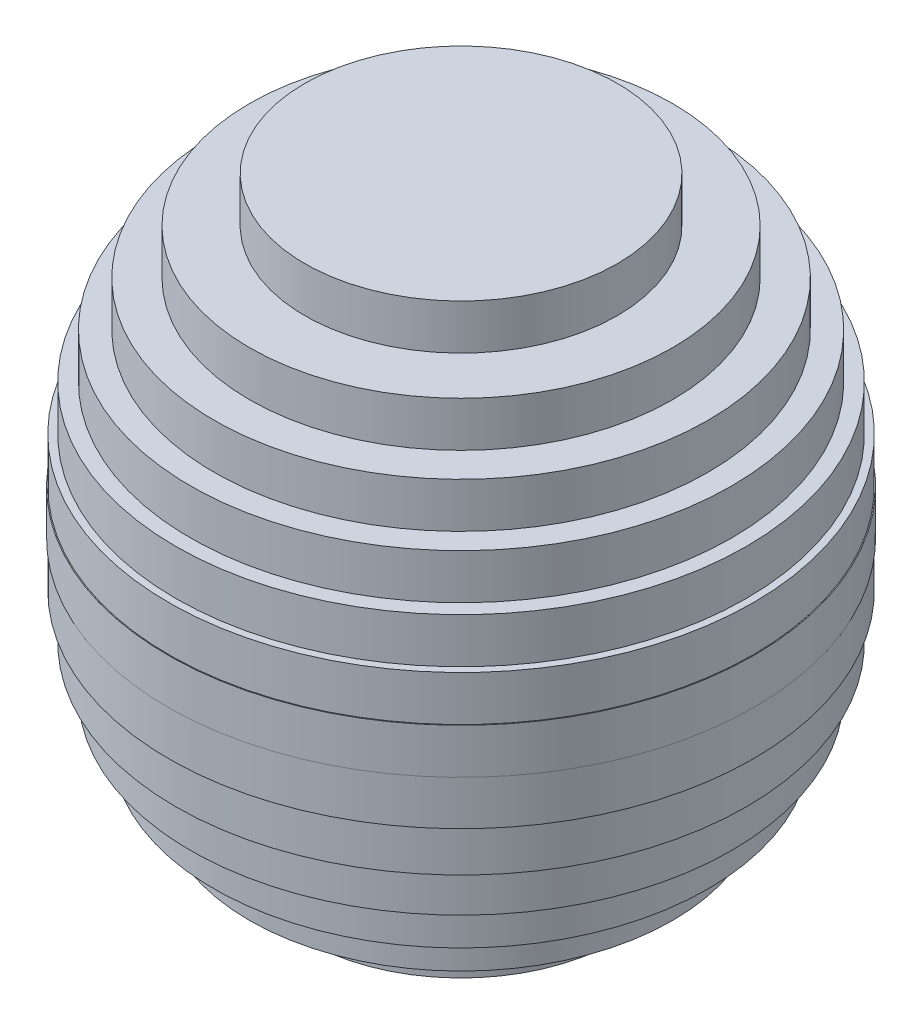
ISO-10303-21;
HEADER;
FILE_DESCRIPTION(('STEP AP214'),'2;1');
FILE_NAME('part.step','',(''),(''),'','','');
FILE_SCHEMA(('AUTOMOTIVE_DESIGN { 1 0 10303 214 1 1 1 1 }'));
ENDSEC;
DATA;
#1=APPLICATION_CONTEXT('core data for automotive mechanical design processes');
#2=APPLICATION_PROTOCOL_DEFINITION('international standard','automotive_design',2000,#1);
#3=PRODUCT_CONTEXT('',#1,'mechanical');
#4=PRODUCT('Part','Part','',(#3));
#5=PRODUCT_RELATED_PRODUCT_CATEGORY('part','',(#4));
#6=PRODUCT_DEFINITION_FORMATION('','',#4);
#7=PRODUCT_DEFINITION_CONTEXT('part definition',#1,'design');
#8=PRODUCT_DEFINITION('design','',#6,#7);
#9=PRODUCT_DEFINITION_SHAPE('','',#8);
#10=(LENGTH_UNIT() NAMED_UNIT(*) SI_UNIT(.MILLI.,.METRE.));
#11=(NAMED_UNIT(*) PLANE_ANGLE_UNIT() SI_UNIT($,.RADIAN.));
#12=(NAMED_UNIT(*) SI_UNIT($,.STERADIAN.) SOLID_ANGLE_UNIT());
#13=UNCERTAINTY_MEASURE_WITH_UNIT(LENGTH_MEASURE(1.E-05),#10,'distance_accuracy_value','');
#14=(GEOMETRIC_REPRESENTATION_CONTEXT(3) GLOBAL_UNCERTAINTY_ASSIGNED_CONTEXT((#13)) GLOBAL_UNIT_ASSIGNED_CONTEXT((#10,
#11,#12)) REPRESENTATION_CONTEXT('',''));
#15=CARTESIAN_POINT('',(0.,0.,0.));
#16=DIRECTION('',(0.,0.,1.));
#17=DIRECTION('',(1.,0.,0.));
#18=AXIS2_PLACEMENT_3D('',#15,#16,#17);
#19=CARTESIAN_POINT('',(32.4037034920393,-2.50000000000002,0.));
#20=DIRECTION('',(0.,-1.,0.));
#21=DIRECTION('',(1.,0.,0.));
#22=AXIS2_PLACEMENT_3D('',#19,#20,#21);
#23=PLANE('',#22);
#24=CARTESIAN_POINT('',(0.,-2.50000000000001,0.));
#25=DIRECTION('',(0.,-1.,0.));
#26=DIRECTION('',(1.,0.,0.));
#27=AXIS2_PLACEMENT_3D('',#24,#25,#26);
#28=CIRCLE('',#27,32.4999999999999);
#29=CARTESIAN_POINT('',(32.4999999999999,-2.50000000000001,0.));
#30=VERTEX_POINT('',#29);
#31=EDGE_CURVE('E10',#30,#30,#28,.T.);
#32=ORIENTED_EDGE('',*,*,#31,.T.);
#33=EDGE_LOOP('',(#32));
#34=FACE_BOUND('',#33,.T.);
#35=CARTESIAN_POINT('',(0.,-2.50000000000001,0.));
#36=DIRECTION('',(0.,-1.,0.));
#37=DIRECTION('',(1.,0.,0.));
#38=AXIS2_PLACEMENT_3D('',#35,#36,#37);
#39=CIRCLE('',#38,32.4037034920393);
#40=CARTESIAN_POINT('',(32.4037034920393,-2.50000000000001,0.));
#41=VERTEX_POINT('',#40);
#42=EDGE_CURVE('E114',#41,#41,#39,.T.);
#43=ORIENTED_EDGE('',*,*,#42,.F.);
#44=EDGE_LOOP('',(#43));
#45=FACE_BOUND('',#44,.T.);
#46=ADVANCED_FACE('F32',(#34,#45),#23,.T.);
#47=CARTESIAN_POINT('',(0.,-32.5,0.));
#48=DIRECTION('',(0.,-1.,0.));
#49=DIRECTION('',(1.,0.,0.));
#50=AXIS2_PLACEMENT_3D('',#47,#48,#49);
#51=CYLINDRICAL_SURFACE('',#50,32.4999999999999);
#52=CARTESIAN_POINT('',(0.,2.49999999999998,0.));
#53=DIRECTION('',(0.,-1.,0.));
#54=DIRECTION('',(1.,0.,0.));
#55=AXIS2_PLACEMENT_3D('',#52,#53,#54);
#56=CIRCLE('',#55,32.4999999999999);
#57=CARTESIAN_POINT('',(32.4999999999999,2.49999999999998,0.));
#58=VERTEX_POINT('',#57);
#59=EDGE_CURVE('E38',#58,#58,#56,.T.);
#60=ORIENTED_EDGE('',*,*,#59,.T.);
#61=EDGE_LOOP('',(#60));
#62=FACE_BOUND('',#61,.T.);
#63=ORIENTED_EDGE('',*,*,#31,.F.);
#64=EDGE_LOOP('',(#63));
#65=FACE_BOUND('',#64,.T.);
#66=ADVANCED_FACE('F122',(#62,#65),#51,.T.);
#67=CARTESIAN_POINT('',(32.4999999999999,2.49999999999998,0.));
#68=DIRECTION('',(0.,1.,0.));
#69=DIRECTION('',(-1.,0.,0.));
#70=AXIS2_PLACEMENT_3D('',#67,#68,#69);
#71=PLANE('',#70);
#72=CARTESIAN_POINT('',(0.,2.49999999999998,0.));
#73=DIRECTION('',(0.,-1.,0.));
#74=DIRECTION('',(1.,0.,0.));
#75=AXIS2_PLACEMENT_3D('',#72,#73,#74);
#76=CIRCLE('',#75,32.4037034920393);
#77=CARTESIAN_POINT('',(32.4037034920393,2.49999999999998,0.));
#78=VERTEX_POINT('',#77);
#79=EDGE_CURVE('E42',#78,#78,#76,.T.);
#80=ORIENTED_EDGE('',*,*,#79,.T.);
#81=EDGE_LOOP('',(#80));
#82=FACE_BOUND('',#81,.T.);
#83=ORIENTED_EDGE('',*,*,#59,.F.);
#84=EDGE_LOOP('',(#83));
#85=FACE_BOUND('',#84,.T.);
#86=ADVANCED_FACE('F126',(#82,#85),#71,.T.);
#87=CARTESIAN_POINT('',(0.,-32.5,0.));
#88=DIRECTION('',(0.,-1.,0.));
#89=DIRECTION('',(1.,0.,0.));
#90=AXIS2_PLACEMENT_3D('',#87,#88,#89);
#91=CYLINDRICAL_SURFACE('',#90,32.4037034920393);
#92=CARTESIAN_POINT('',(0.,7.49999999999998,0.));
#93=DIRECTION('',(0.,-1.,0.));
#94=DIRECTION('',(1.,0.,0.));
#95=AXIS2_PLACEMENT_3D('',#92,#93,#94);
#96=CIRCLE('',#95,32.4037034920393);
#97=CARTESIAN_POINT('',(32.4037034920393,7.49999999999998,0.));
#98=VERTEX_POINT('',#97);
#99=EDGE_CURVE('E46',#98,#98,#96,.T.);
#100=ORIENTED_EDGE('',*,*,#99,.T.);
#101=EDGE_LOOP('',(#100));
#102=FACE_BOUND('',#101,.T.);
#103=ORIENTED_EDGE('',*,*,#79,.F.);
#104=EDGE_LOOP('',(#103));
#105=FACE_BOUND('',#104,.T.);
#106=ADVANCED_FACE('F130',(#102,#105),#91,.T.);
#107=CARTESIAN_POINT('',(32.4037034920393,7.49999999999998,0.));
#108=DIRECTION('',(0.,1.,0.));
#109=DIRECTION('',(-1.,0.,0.));
#110=AXIS2_PLACEMENT_3D('',#107,#108,#109);
#111=PLANE('',#110);
#112=CARTESIAN_POINT('',(0.,7.49999999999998,0.));
#113=DIRECTION('',(0.,-1.,0.));
#114=DIRECTION('',(1.,0.,0.));
#115=AXIS2_PLACEMENT_3D('',#112,#113,#114);
#116=CIRCLE('',#115,31.6227766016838);
#117=CARTESIAN_POINT('',(31.6227766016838,7.49999999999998,0.));
#118=VERTEX_POINT('',#117);
#119=EDGE_CURVE('E51',#118,#118,#116,.T.);
#120=ORIENTED_EDGE('',*,*,#119,.T.);
#121=EDGE_LOOP('',(#120));
#122=FACE_BOUND('',#121,.T.);
#123=ORIENTED_EDGE('',*,*,#99,.F.);
#124=EDGE_LOOP('',(#123));
#125=FACE_BOUND('',#124,.T.);
#126=ADVANCED_FACE('F137',(#122,#125),#111,.T.);
#127=CARTESIAN_POINT('',(0.,-32.5,0.));
#128=DIRECTION('',(0.,-1.,0.));
#129=DIRECTION('',(1.,0.,0.));
#130=AXIS2_PLACEMENT_3D('',#127,#128,#129);
#131=CYLINDRICAL_SURFACE('',#130,31.6227766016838);
#132=CARTESIAN_POINT('',(0.,12.5,0.));
#133=DIRECTION('',(0.,-1.,0.));
#134=DIRECTION('',(1.,0.,0.));
#135=AXIS2_PLACEMENT_3D('',#132,#133,#134);
#136=CIRCLE('',#135,31.6227766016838);
#137=CARTESIAN_POINT('',(31.6227766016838,12.5,0.));
#138=VERTEX_POINT('',#137);
#139=EDGE_CURVE('E54',#138,#138,#136,.T.);
#140=ORIENTED_EDGE('',*,*,#139,.T.);
#141=EDGE_LOOP('',(#140));
#142=FACE_BOUND('',#141,.T.);
#143=ORIENTED_EDGE('',*,*,#119,.F.);
#144=EDGE_LOOP('',(#143));
#145=FACE_BOUND('',#144,.T.);
#146=ADVANCED_FACE('F141',(#142,#145),#131,.T.);
#147=CARTESIAN_POINT('',(31.6227766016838,12.5,0.));
#148=DIRECTION('',(0.,1.,0.));
#149=DIRECTION('',(-1.,0.,0.));
#150=AXIS2_PLACEMENT_3D('',#147,#148,#149);
#151=PLANE('',#150);
#152=CARTESIAN_POINT('',(0.,12.5,0.));
#153=DIRECTION('',(0.,-1.,0.));
#154=DIRECTION('',(1.,0.,0.));
#155=AXIS2_PLACEMENT_3D('',#152,#153,#154);
#156=CIRCLE('',#155,30.);
#157=CARTESIAN_POINT('',(30.,12.5,0.));
#158=VERTEX_POINT('',#157);
#159=EDGE_CURVE('E57',#158,#158,#156,.T.);
#160=ORIENTED_EDGE('',*,*,#159,.T.);
#161=EDGE_LOOP('',(#160));
#162=FACE_BOUND('',#161,.T.);
#163=ORIENTED_EDGE('',*,*,#139,.F.);
#164=EDGE_LOOP('',(#163));
#165=FACE_BOUND('',#164,.T.);
#166=ADVANCED_FACE('F145',(#162,#165),#151,.T.);
#167=CARTESIAN_POINT('',(0.,-32.5,0.));
#168=DIRECTION('',(0.,-1.,0.));
#169=DIRECTION('',(1.,0.,0.));
#170=AXIS2_PLACEMENT_3D('',#167,#168,#169);
#171=CYLINDRICAL_SURFACE('',#170,30.);
#172=CARTESIAN_POINT('',(0.,17.5,0.));
#173=DIRECTION('',(0.,-1.,0.));
#174=DIRECTION('',(1.,0.,0.));
#175=AXIS2_PLACEMENT_3D('',#172,#173,#174);
#176=CIRCLE('',#175,30.);
#177=CARTESIAN_POINT('',(30.,17.5,0.));
#178=VERTEX_POINT('',#177);
#179=EDGE_CURVE('E60',#178,#178,#176,.T.);
#180=ORIENTED_EDGE('',*,*,#179,.T.);
#181=EDGE_LOOP('',(#180));
#182=FACE_BOUND('',#181,.T.);
#183=ORIENTED_EDGE('',*,*,#159,.F.);
#184=EDGE_LOOP('',(#183));
#185=FACE_BOUND('',#184,.T.);
#186=ADVANCED_FACE('F149',(#182,#185),#171,.T.);
#187=CARTESIAN_POINT('',(30.,17.5,0.));
#188=DIRECTION('',(0.,1.,0.));
#189=DIRECTION('',(-1.,0.,0.));
#190=AXIS2_PLACEMENT_3D('',#187,#188,#189);
#191=PLANE('',#190);
#192=CARTESIAN_POINT('',(0.,17.5,0.));
#193=DIRECTION('',(0.,-1.,0.));
#194=DIRECTION('',(1.,0.,0.));
#195=AXIS2_PLACEMENT_3D('',#192,#193,#194);
#196=CIRCLE('',#195,27.3861278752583);
#197=CARTESIAN_POINT('',(27.3861278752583,17.5,0.));
#198=VERTEX_POINT('',#197);
#199=EDGE_CURVE('E63',#198,#198,#196,.T.);
#200=ORIENTED_EDGE('',*,*,#199,.T.);
#201=EDGE_LOOP('',(#200));
#202=FACE_BOUND('',#201,.T.);
#203=ORIENTED_EDGE('',*,*,#179,.F.);
#204=EDGE_LOOP('',(#203));
#205=FACE_BOUND('',#204,.T.);
#206=ADVANCED_FACE('F153',(#202,#205),#191,.T.);
#207=CARTESIAN_POINT('',(0.,-32.5,0.));
#208=DIRECTION('',(0.,-1.,0.));
#209=DIRECTION('',(1.,0.,0.));
#210=AXIS2_PLACEMENT_3D('',#207,#208,#209);
#211=CYLINDRICAL_SURFACE('',#210,27.3861278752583);
#212=CARTESIAN_POINT('',(0.,22.5,0.));
#213=DIRECTION('',(0.,-1.,0.));
#214=DIRECTION('',(1.,0.,0.));
#215=AXIS2_PLACEMENT_3D('',#212,#213,#214);
#216=CIRCLE('',#215,27.3861278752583);
#217=CARTESIAN_POINT('',(27.3861278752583,22.5,0.));
#218=VERTEX_POINT('',#217);
#219=EDGE_CURVE('E66',#218,#218,#216,.T.);
#220=ORIENTED_EDGE('',*,*,#219,.T.);
#221=EDGE_LOOP('',(#220));
#222=FACE_BOUND('',#221,.T.);
#223=ORIENTED_EDGE('',*,*,#199,.F.);
#224=EDGE_LOOP('',(#223));
#225=FACE_BOUND('',#224,.T.);
#226=ADVANCED_FACE('F157',(#222,#225),#211,.T.);
#227=CARTESIAN_POINT('',(27.3861278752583,22.5,0.));
#228=DIRECTION('',(0.,1.,0.));
#229=DIRECTION('',(-1.,0.,0.));
#230=AXIS2_PLACEMENT_3D('',#227,#228,#229);
#231=PLANE('',#230);
#232=CARTESIAN_POINT('',(0.,22.5,0.));
#233=DIRECTION('',(0.,-1.,0.));
#234=DIRECTION('',(1.,0.,0.));
#235=AXIS2_PLACEMENT_3D('',#232,#233,#234);
#236=CIRCLE('',#235,23.4520787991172);
#237=CARTESIAN_POINT('',(23.4520787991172,22.5,0.));
#238=VERTEX_POINT('',#237);
#239=EDGE_CURVE('E69',#238,#238,#236,.T.);
#240=ORIENTED_EDGE('',*,*,#239,.T.);
#241=EDGE_LOOP('',(#240));
#242=FACE_BOUND('',#241,.T.);
#243=ORIENTED_EDGE('',*,*,#219,.F.);
#244=EDGE_LOOP('',(#243));
#245=FACE_BOUND('',#244,.T.);
#246=ADVANCED_FACE('F161',(#242,#245),#231,.T.);
#247=CARTESIAN_POINT('',(0.,-32.5,0.));
#248=DIRECTION('',(0.,-1.,0.));
#249=DIRECTION('',(1.,0.,0.));
#250=AXIS2_PLACEMENT_3D('',#247,#248,#249);
#251=CYLINDRICAL_SURFACE('',#250,23.4520787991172);
#252=CARTESIAN_POINT('',(0.,27.5,0.));
#253=DIRECTION('',(0.,-1.,0.));
#254=DIRECTION('',(1.,0.,0.));
#255=AXIS2_PLACEMENT_3D('',#252,#253,#254);
#256=CIRCLE('',#255,23.4520787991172);
#257=CARTESIAN_POINT('',(23.4520787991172,27.5,0.));
#258=VERTEX_POINT('',#257);
#259=EDGE_CURVE('E72',#258,#258,#256,.T.);
#260=ORIENTED_EDGE('',*,*,#259,.T.);
#261=EDGE_LOOP('',(#260));
#262=FACE_BOUND('',#261,.T.);
#263=ORIENTED_EDGE('',*,*,#239,.F.);
#264=EDGE_LOOP('',(#263));
#265=FACE_BOUND('',#264,.T.);
#266=ADVANCED_FACE('F165',(#262,#265),#251,.T.);
#267=CARTESIAN_POINT('',(23.4520787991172,27.5,0.));
#268=DIRECTION('',(0.,1.,0.));
#269=DIRECTION('',(-1.,0.,0.));
#270=AXIS2_PLACEMENT_3D('',#267,#268,#269);
#271=PLANE('',#270);
#272=CARTESIAN_POINT('',(0.,27.5,0.));
#273=DIRECTION('',(0.,-1.,0.));
#274=DIRECTION('',(1.,0.,0.));
#275=AXIS2_PLACEMENT_3D('',#272,#273,#274);
#276=CIRCLE('',#275,17.3205080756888);
#277=CARTESIAN_POINT('',(17.3205080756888,27.5,0.));
#278=VERTEX_POINT('',#277);
#279=EDGE_CURVE('E75',#278,#278,#276,.T.);
#280=ORIENTED_EDGE('',*,*,#279,.T.);
#281=EDGE_LOOP('',(#280));
#282=FACE_BOUND('',#281,.T.);
#283=ORIENTED_EDGE('',*,*,#259,.F.);
#284=EDGE_LOOP('',(#283));
#285=FACE_BOUND('',#284,.T.);
#286=ADVANCED_FACE('F169',(#282,#285),#271,.T.);
#287=CARTESIAN_POINT('',(0.,-32.5,0.));
#288=DIRECTION('',(0.,-1.,0.));
#289=DIRECTION('',(1.,0.,0.));
#290=AXIS2_PLACEMENT_3D('',#287,#288,#289);
#291=CYLINDRICAL_SURFACE('',#290,17.3205080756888);
#292=CARTESIAN_POINT('',(0.,32.5,0.));
#293=DIRECTION('',(0.,-1.,0.));
#294=DIRECTION('',(1.,0.,0.));
#295=AXIS2_PLACEMENT_3D('',#292,#293,#294);
#296=CIRCLE('',#295,17.3205080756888);
#297=CARTESIAN_POINT('',(17.3205080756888,32.5,0.));
#298=VERTEX_POINT('',#297);
#299=EDGE_CURVE('E78',#298,#298,#296,.T.);
#300=ORIENTED_EDGE('',*,*,#299,.T.);
#301=EDGE_LOOP('',(#300));
#302=FACE_BOUND('',#301,.T.);
#303=ORIENTED_EDGE('',*,*,#279,.F.);
#304=EDGE_LOOP('',(#303));
#305=FACE_BOUND('',#304,.T.);
#306=ADVANCED_FACE('F173',(#302,#305),#291,.T.);
#307=CARTESIAN_POINT('',(17.3205080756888,32.5,0.));
#308=DIRECTION('',(0.,1.,0.));
#309=DIRECTION('',(-1.,0.,0.));
#310=AXIS2_PLACEMENT_3D('',#307,#308,#309);
#311=PLANE('',#310);
#312=ORIENTED_EDGE('',*,*,#299,.F.);
#313=EDGE_LOOP('',(#312));
#314=FACE_BOUND('',#313,.T.);
#315=ADVANCED_FACE('F177',(#314),#311,.T.);
#316=CARTESIAN_POINT('',(17.3205080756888,-32.5,0.));
#317=DIRECTION('',(0.,-1.,0.));
#318=DIRECTION('',(1.,0.,0.));
#319=AXIS2_PLACEMENT_3D('',#316,#317,#318);
#320=PLANE('',#319);
#321=CARTESIAN_POINT('',(0.,-32.5,0.));
#322=DIRECTION('',(0.,-1.,0.));
#323=DIRECTION('',(1.,0.,0.));
#324=AXIS2_PLACEMENT_3D('',#321,#322,#323);
#325=CIRCLE('',#324,17.3205080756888);
#326=CARTESIAN_POINT('',(17.3205080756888,-32.5,0.));
#327=VERTEX_POINT('',#326);
#328=EDGE_CURVE('E81',#327,#327,#325,.T.);
#329=ORIENTED_EDGE('',*,*,#328,.T.);
#330=EDGE_LOOP('',(#329));
#331=FACE_BOUND('',#330,.T.);
#332=ADVANCED_FACE('F181',(#331),#320,.T.);
#333=CARTESIAN_POINT('',(0.,-32.5,0.));
#334=DIRECTION('',(0.,-1.,0.));
#335=DIRECTION('',(1.,0.,0.));
#336=AXIS2_PLACEMENT_3D('',#333,#334,#335);
#337=CYLINDRICAL_SURFACE('',#336,17.3205080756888);
#338=CARTESIAN_POINT('',(0.,-27.5,0.));
#339=DIRECTION('',(0.,-1.,0.));
#340=DIRECTION('',(1.,0.,0.));
#341=AXIS2_PLACEMENT_3D('',#338,#339,#340);
#342=CIRCLE('',#341,17.3205080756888);
#343=CARTESIAN_POINT('',(17.3205080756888,-27.5,0.));
#344=VERTEX_POINT('',#343);
#345=EDGE_CURVE('E84',#344,#344,#342,.T.);
#346=ORIENTED_EDGE('',*,*,#345,.T.);
#347=EDGE_LOOP('',(#346));
#348=FACE_BOUND('',#347,.T.);
#349=ORIENTED_EDGE('',*,*,#328,.F.);
#350=EDGE_LOOP('',(#349));
#351=FACE_BOUND('',#350,.T.);
#352=ADVANCED_FACE('F185',(#348,#351),#337,.T.);
#353=CARTESIAN_POINT('',(23.4520787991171,-27.5,0.));
#354=DIRECTION('',(0.,-1.,0.));
#355=DIRECTION('',(1.,0.,0.));
#356=AXIS2_PLACEMENT_3D('',#353,#354,#355);
#357=PLANE('',#356);
#358=CARTESIAN_POINT('',(0.,-27.5,0.));
#359=DIRECTION('',(0.,-1.,0.));
#360=DIRECTION('',(1.,0.,0.));
#361=AXIS2_PLACEMENT_3D('',#358,#359,#360);
#362=CIRCLE('',#361,23.4520787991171);
#363=CARTESIAN_POINT('',(23.4520787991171,-27.5,0.));
#364=VERTEX_POINT('',#363);
#365=EDGE_CURVE('E87',#364,#364,#362,.T.);
#366=ORIENTED_EDGE('',*,*,#365,.T.);
#367=EDGE_LOOP('',(#366));
#368=FACE_BOUND('',#367,.T.);
#369=ORIENTED_EDGE('',*,*,#345,.F.);
#370=EDGE_LOOP('',(#369));
#371=FACE_BOUND('',#370,.T.);
#372=ADVANCED_FACE('F189',(#368,#371),#357,.T.);
#373=CARTESIAN_POINT('',(0.,-32.5,0.));
#374=DIRECTION('',(0.,-1.,0.));
#375=DIRECTION('',(1.,0.,0.));
#376=AXIS2_PLACEMENT_3D('',#373,#374,#375);
#377=CYLINDRICAL_SURFACE('',#376,23.4520787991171);
#378=CARTESIAN_POINT('',(0.,-22.5,0.));
#379=DIRECTION('',(0.,-1.,0.));
#380=DIRECTION('',(1.,0.,0.));
#381=AXIS2_PLACEMENT_3D('',#378,#379,#380);
#382=CIRCLE('',#381,23.4520787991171);
#383=CARTESIAN_POINT('',(23.4520787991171,-22.5,0.));
#384=VERTEX_POINT('',#383);
#385=EDGE_CURVE('E90',#384,#384,#382,.T.);
#386=ORIENTED_EDGE('',*,*,#385,.T.);
#387=EDGE_LOOP('',(#386));
#388=FACE_BOUND('',#387,.T.);
#389=ORIENTED_EDGE('',*,*,#365,.F.);
#390=EDGE_LOOP('',(#389));
#391=FACE_BOUND('',#390,.T.);
#392=ADVANCED_FACE('F193',(#388,#391),#377,.T.);
#393=CARTESIAN_POINT('',(27.3861278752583,-22.5,0.));
#394=DIRECTION('',(0.,-1.,0.));
#395=DIRECTION('',(1.,0.,0.));
#396=AXIS2_PLACEMENT_3D('',#393,#394,#395);
#397=PLANE('',#396);
#398=CARTESIAN_POINT('',(0.,-22.5,0.));
#399=DIRECTION('',(0.,-1.,0.));
#400=DIRECTION('',(1.,0.,0.));
#401=AXIS2_PLACEMENT_3D('',#398,#399,#400);
#402=CIRCLE('',#401,27.3861278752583);
#403=CARTESIAN_POINT('',(27.3861278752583,-22.5,0.));
#404=VERTEX_POINT('',#403);
#405=EDGE_CURVE('E93',#404,#404,#402,.T.);
#406=ORIENTED_EDGE('',*,*,#405,.T.);
#407=EDGE_LOOP('',(#406));
#408=FACE_BOUND('',#407,.T.);
#409=ORIENTED_EDGE('',*,*,#385,.F.);
#410=EDGE_LOOP('',(#409));
#411=FACE_BOUND('',#410,.T.);
#412=ADVANCED_FACE('F197',(#408,#411),#397,.T.);
#413=CARTESIAN_POINT('',(0.,-32.5,0.));
#414=DIRECTION('',(0.,-1.,0.));
#415=DIRECTION('',(1.,0.,0.));
#416=AXIS2_PLACEMENT_3D('',#413,#414,#415);
#417=CYLINDRICAL_SURFACE('',#416,27.3861278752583);
#418=CARTESIAN_POINT('',(0.,-17.5,0.));
#419=DIRECTION('',(0.,-1.,0.));
#420=DIRECTION('',(1.,0.,0.));
#421=AXIS2_PLACEMENT_3D('',#418,#419,#420);
#422=CIRCLE('',#421,27.3861278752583);
#423=CARTESIAN_POINT('',(27.3861278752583,-17.5,0.));
#424=VERTEX_POINT('',#423);
#425=EDGE_CURVE('E96',#424,#424,#422,.T.);
#426=ORIENTED_EDGE('',*,*,#425,.T.);
#427=EDGE_LOOP('',(#426));
#428=FACE_BOUND('',#427,.T.);
#429=ORIENTED_EDGE('',*,*,#405,.F.);
#430=EDGE_LOOP('',(#429));
#431=FACE_BOUND('',#430,.T.);
#432=ADVANCED_FACE('F201',(#428,#431),#417,.T.);
#433=CARTESIAN_POINT('',(30.,-17.5,0.));
#434=DIRECTION('',(0.,-1.,0.));
#435=DIRECTION('',(1.,0.,0.));
#436=AXIS2_PLACEMENT_3D('',#433,#434,#435);
#437=PLANE('',#436);
#438=CARTESIAN_POINT('',(0.,-17.5,0.));
#439=DIRECTION('',(0.,-1.,0.));
#440=DIRECTION('',(1.,0.,0.));
#441=AXIS2_PLACEMENT_3D('',#438,#439,#440);
#442=CIRCLE('',#441,30.);
#443=CARTESIAN_POINT('',(30.,-17.5,0.));
#444=VERTEX_POINT('',#443);
#445=EDGE_CURVE('E99',#444,#444,#442,.T.);
#446=ORIENTED_EDGE('',*,*,#445,.T.);
#447=EDGE_LOOP('',(#446));
#448=FACE_BOUND('',#447,.T.);
#449=ORIENTED_EDGE('',*,*,#425,.F.);
#450=EDGE_LOOP('',(#449));
#451=FACE_BOUND('',#450,.T.);
#452=ADVANCED_FACE('F205',(#448,#451),#437,.T.);
#453=CARTESIAN_POINT('',(0.,-32.5,0.));
#454=DIRECTION('',(0.,-1.,0.));
#455=DIRECTION('',(1.,0.,0.));
#456=AXIS2_PLACEMENT_3D('',#453,#454,#455);
#457=CYLINDRICAL_SURFACE('',#456,30.);
#458=CARTESIAN_POINT('',(0.,-12.5,0.));
#459=DIRECTION('',(0.,-1.,0.));
#460=DIRECTION('',(1.,0.,0.));
#461=AXIS2_PLACEMENT_3D('',#458,#459,#460);
#462=CIRCLE('',#461,30.);
#463=CARTESIAN_POINT('',(30.,-12.5,0.));
#464=VERTEX_POINT('',#463);
#465=EDGE_CURVE('E102',#464,#464,#462,.T.);
#466=ORIENTED_EDGE('',*,*,#465,.T.);
#467=EDGE_LOOP('',(#466));
#468=FACE_BOUND('',#467,.T.);
#469=ORIENTED_EDGE('',*,*,#445,.F.);
#470=EDGE_LOOP('',(#469));
#471=FACE_BOUND('',#470,.T.);
#472=ADVANCED_FACE('F209',(#468,#471),#457,.T.);
#473=CARTESIAN_POINT('',(31.6227766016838,-12.5,0.));
#474=DIRECTION('',(0.,-1.,0.));
#475=DIRECTION('',(1.,0.,0.));
#476=AXIS2_PLACEMENT_3D('',#473,#474,#475);
#477=PLANE('',#476);
#478=CARTESIAN_POINT('',(0.,-12.5,0.));
#479=DIRECTION('',(0.,-1.,0.));
#480=DIRECTION('',(1.,0.,0.));
#481=AXIS2_PLACEMENT_3D('',#478,#479,#480);
#482=CIRCLE('',#481,31.6227766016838);
#483=CARTESIAN_POINT('',(31.6227766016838,-12.5,0.));
#484=VERTEX_POINT('',#483);
#485=EDGE_CURVE('E105',#484,#484,#482,.T.);
#486=ORIENTED_EDGE('',*,*,#485,.T.);
#487=EDGE_LOOP('',(#486));
#488=FACE_BOUND('',#487,.T.);
#489=ORIENTED_EDGE('',*,*,#465,.F.);
#490=EDGE_LOOP('',(#489));
#491=FACE_BOUND('',#490,.T.);
#492=ADVANCED_FACE('F213',(#488,#491),#477,.T.);
#493=CARTESIAN_POINT('',(0.,-32.5,0.));
#494=DIRECTION('',(0.,-1.,0.));
#495=DIRECTION('',(1.,0.,0.));
#496=AXIS2_PLACEMENT_3D('',#493,#494,#495);
#497=CYLINDRICAL_SURFACE('',#496,31.6227766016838);
#498=CARTESIAN_POINT('',(0.,-7.50000000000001,0.));
#499=DIRECTION('',(0.,-1.,0.));
#500=DIRECTION('',(1.,0.,0.));
#501=AXIS2_PLACEMENT_3D('',#498,#499,#500);
#502=CIRCLE('',#501,31.6227766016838);
#503=CARTESIAN_POINT('',(31.6227766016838,-7.50000000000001,0.));
#504=VERTEX_POINT('',#503);
#505=EDGE_CURVE('E108',#504,#504,#502,.T.);
#506=ORIENTED_EDGE('',*,*,#505,.T.);
#507=EDGE_LOOP('',(#506));
#508=FACE_BOUND('',#507,.T.);
#509=ORIENTED_EDGE('',*,*,#485,.F.);
#510=EDGE_LOOP('',(#509));
#511=FACE_BOUND('',#510,.T.);
#512=ADVANCED_FACE('F217',(#508,#511),#497,.T.);
#513=CARTESIAN_POINT('',(32.4037034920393,-7.50000000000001,0.));
#514=DIRECTION('',(0.,-1.,0.));
#515=DIRECTION('',(1.,0.,0.));
#516=AXIS2_PLACEMENT_3D('',#513,#514,#515);
#517=PLANE('',#516);
#518=CARTESIAN_POINT('',(0.,-7.50000000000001,0.));
#519=DIRECTION('',(0.,-1.,0.));
#520=DIRECTION('',(1.,0.,0.));
#521=AXIS2_PLACEMENT_3D('',#518,#519,#520);
#522=CIRCLE('',#521,32.4037034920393);
#523=CARTESIAN_POINT('',(32.4037034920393,-7.50000000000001,0.));
#524=VERTEX_POINT('',#523);
#525=EDGE_CURVE('E111',#524,#524,#522,.T.);
#526=ORIENTED_EDGE('',*,*,#525,.T.);
#527=EDGE_LOOP('',(#526));
#528=FACE_BOUND('',#527,.T.);
#529=ORIENTED_EDGE('',*,*,#505,.F.);
#530=EDGE_LOOP('',(#529));
#531=FACE_BOUND('',#530,.T.);
#532=ADVANCED_FACE('F221',(#528,#531),#517,.T.);
#533=CARTESIAN_POINT('',(0.,-32.5,0.));
#534=DIRECTION('',(0.,-1.,0.));
#535=DIRECTION('',(1.,0.,0.));
#536=AXIS2_PLACEMENT_3D('',#533,#534,#535);
#537=CYLINDRICAL_SURFACE('',#536,32.4037034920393);
#538=ORIENTED_EDGE('',*,*,#42,.T.);
#539=EDGE_LOOP('',(#538));
#540=FACE_BOUND('',#539,.T.);
#541=ORIENTED_EDGE('',*,*,#525,.F.);
#542=EDGE_LOOP('',(#541));
#543=FACE_BOUND('',#542,.T.);
#544=ADVANCED_FACE('F118',(#540,#543),#537,.T.);
#545=CLOSED_SHELL('',(#46,#66,#86,#106,#126,#146,#166,#186,#206,#226,#246,#266,#286,#306,#315,
#332,#352,#372,#392,#412,#432,#452,#472,#492,#512,#532,#544));
#546=MANIFOLD_SOLID_BREP('B2',#545);
#547=ADVANCED_BREP_SHAPE_REPRESENTATION('',(#18,#546),#14);
#548=SHAPE_DEFINITION_REPRESENTATION(#9,#547);
ENDSEC;
END-ISO-10303-21;
